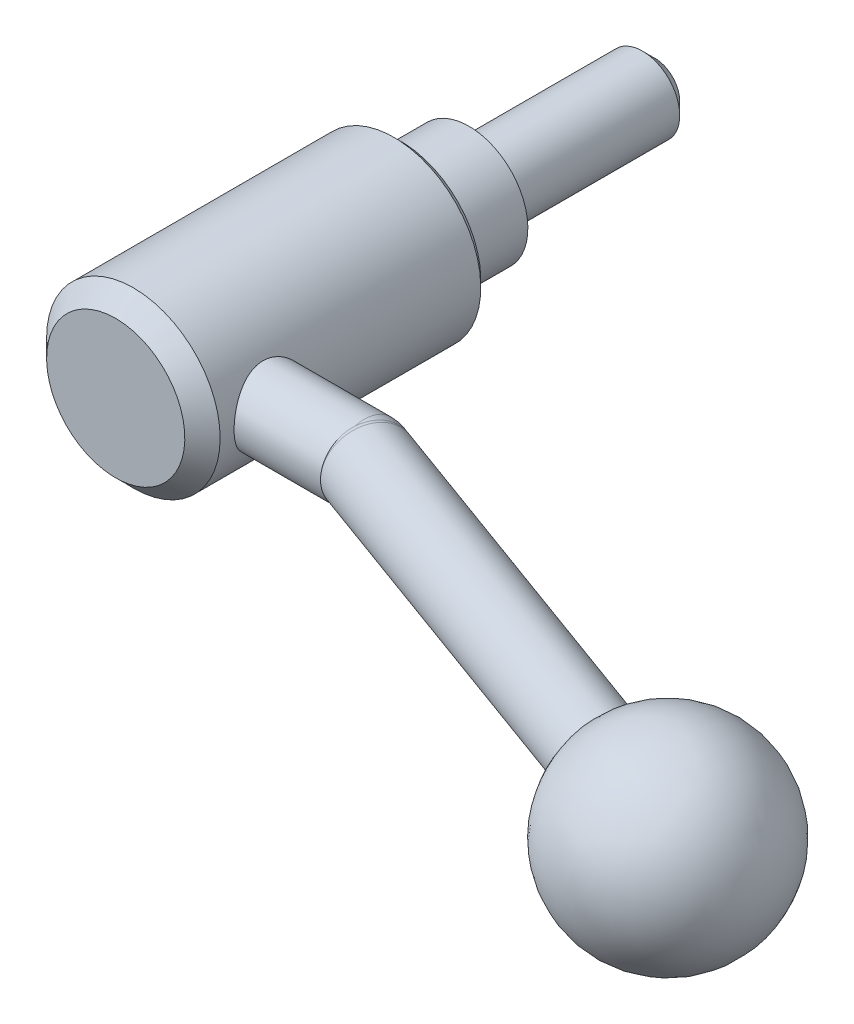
ISO-10303-21;
HEADER;
FILE_DESCRIPTION(('STEP AP214'),'2;1');
FILE_NAME('part.step','',(''),(''),'','','');
FILE_SCHEMA(('AUTOMOTIVE_DESIGN { 1 0 10303 214 1 1 1 1 }'));
ENDSEC;
DATA;
#1=APPLICATION_CONTEXT('core data for automotive mechanical design processes');
#2=APPLICATION_PROTOCOL_DEFINITION('international standard','automotive_design',2000,#1);
#3=PRODUCT_CONTEXT('',#1,'mechanical');
#4=PRODUCT('Part','Part','',(#3));
#5=PRODUCT_RELATED_PRODUCT_CATEGORY('part','',(#4));
#6=PRODUCT_DEFINITION_FORMATION('','',#4);
#7=PRODUCT_DEFINITION_CONTEXT('part definition',#1,'design');
#8=PRODUCT_DEFINITION('design','',#6,#7);
#9=PRODUCT_DEFINITION_SHAPE('','',#8);
#10=(LENGTH_UNIT() NAMED_UNIT(*) SI_UNIT(.MILLI.,.METRE.));
#11=(NAMED_UNIT(*) PLANE_ANGLE_UNIT() SI_UNIT($,.RADIAN.));
#12=(NAMED_UNIT(*) SI_UNIT($,.STERADIAN.) SOLID_ANGLE_UNIT());
#13=UNCERTAINTY_MEASURE_WITH_UNIT(LENGTH_MEASURE(1.E-05),#10,'distance_accuracy_value','');
#14=(GEOMETRIC_REPRESENTATION_CONTEXT(3) GLOBAL_UNCERTAINTY_ASSIGNED_CONTEXT((#13)) GLOBAL_UNIT_ASSIGNED_CONTEXT((#10,
#11,#12)) REPRESENTATION_CONTEXT('',''));
#15=CARTESIAN_POINT('',(0.,0.,0.));
#16=DIRECTION('',(0.,0.,1.));
#17=DIRECTION('',(1.,0.,0.));
#18=AXIS2_PLACEMENT_3D('',#15,#16,#17);
#19=CARTESIAN_POINT('',(0.,0.,-14.463244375));
#20=DIRECTION('',(0.,0.,1.));
#21=DIRECTION('',(0.,-1.,0.));
#22=AXIS2_PLACEMENT_3D('',#19,#20,#21);
#23=CYLINDRICAL_SURFACE('',#22,6.);
#24=CARTESIAN_POINT('',(0.,0.,-28.));
#25=DIRECTION('',(0.,0.,-1.));
#26=DIRECTION('',(-1.,0.,0.));
#27=AXIS2_PLACEMENT_3D('',#24,#25,#26);
#28=CIRCLE('',#27,6.);
#29=CARTESIAN_POINT('',(-6.,0.,-28.));
#30=VERTEX_POINT('',#29);
#31=EDGE_CURVE('E9',#30,#30,#28,.F.);
#32=ORIENTED_EDGE('',*,*,#31,.T.);
#33=EDGE_LOOP('',(#32));
#34=FACE_BOUND('',#33,.T.);
#35=CARTESIAN_POINT('',(0.,0.,0.));
#36=DIRECTION('',(0.,0.,1.));
#37=DIRECTION('',(0.,-1.,0.));
#38=AXIS2_PLACEMENT_3D('',#35,#36,#37);
#39=CIRCLE('',#38,6.);
#40=CARTESIAN_POINT('',(0.,-6.,0.));
#41=VERTEX_POINT('',#40);
#42=EDGE_CURVE('E144',#41,#41,#39,.T.);
#43=ORIENTED_EDGE('',*,*,#42,.F.);
#44=EDGE_LOOP('',(#43));
#45=FACE_BOUND('',#44,.T.);
#46=ADVANCED_FACE('F14',(#34,#45),#23,.T.);
#47=CARTESIAN_POINT('',(7.75,0.,0.));
#48=DIRECTION('',(0.,0.,-1.));
#49=DIRECTION('',(0.,1.,0.));
#50=AXIS2_PLACEMENT_3D('',#47,#48,#49);
#51=PLANE('',#50);
#52=ORIENTED_EDGE('',*,*,#42,.T.);
#53=EDGE_LOOP('',(#52));
#54=FACE_BOUND('',#53,.T.);
#55=CARTESIAN_POINT('',(0.,0.,0.));
#56=DIRECTION('',(0.,0.,1.));
#57=DIRECTION('',(0.,-1.,0.));
#58=AXIS2_PLACEMENT_3D('',#55,#56,#57);
#59=CIRCLE('',#58,9.5);
#60=CARTESIAN_POINT('',(0.,-9.5,0.));
#61=VERTEX_POINT('',#60);
#62=EDGE_CURVE('E141',#61,#61,#59,.T.);
#63=ORIENTED_EDGE('',*,*,#62,.F.);
#64=EDGE_LOOP('',(#63));
#65=FACE_BOUND('',#64,.T.);
#66=ADVANCED_FACE('F148',(#54,#65),#51,.T.);
#67=CARTESIAN_POINT('',(0.,0.,5.5));
#68=DIRECTION('',(0.,0.,1.));
#69=DIRECTION('',(0.,-1.,0.));
#70=AXIS2_PLACEMENT_3D('',#67,#68,#69);
#71=CYLINDRICAL_SURFACE('',#70,9.5);
#72=CARTESIAN_POINT('',(0.,0.,11.));
#73=DIRECTION('',(0.,0.,1.));
#74=DIRECTION('',(0.,-1.,0.));
#75=AXIS2_PLACEMENT_3D('',#72,#73,#74);
#76=CIRCLE('',#75,9.5);
#77=CARTESIAN_POINT('',(0.,-9.5,11.));
#78=VERTEX_POINT('',#77);
#79=EDGE_CURVE('E136',#78,#78,#76,.T.);
#80=ORIENTED_EDGE('',*,*,#79,.F.);
#81=EDGE_LOOP('',(#80));
#82=FACE_BOUND('',#81,.T.);
#83=ORIENTED_EDGE('',*,*,#62,.T.);
#84=EDGE_LOOP('',(#83));
#85=FACE_BOUND('',#84,.T.);
#86=ADVANCED_FACE('F158',(#82,#85),#71,.T.);
#87=CARTESIAN_POINT('',(11.2,0.,11.));
#88=DIRECTION('',(0.,0.,-1.));
#89=DIRECTION('',(0.,1.,0.));
#90=AXIS2_PLACEMENT_3D('',#87,#88,#89);
#91=PLANE('',#90);
#92=ORIENTED_EDGE('',*,*,#79,.T.);
#93=EDGE_LOOP('',(#92));
#94=FACE_BOUND('',#93,.T.);
#95=CARTESIAN_POINT('',(0.,0.,11.));
#96=DIRECTION('',(0.,0.,1.));
#97=DIRECTION('',(0.,-1.,0.));
#98=AXIS2_PLACEMENT_3D('',#95,#96,#97);
#99=CIRCLE('',#98,12.9);
#100=CARTESIAN_POINT('',(0.,-12.9,11.));
#101=VERTEX_POINT('',#100);
#102=EDGE_CURVE('E134',#101,#101,#99,.T.);
#103=ORIENTED_EDGE('',*,*,#102,.F.);
#104=EDGE_LOOP('',(#103));
#105=FACE_BOUND('',#104,.T.);
#106=ADVANCED_FACE('F163',(#94,#105),#91,.T.);
#107=CARTESIAN_POINT('',(5.575,0.,57.));
#108=DIRECTION('',(0.,0.,1.));
#109=DIRECTION('',(0.,-1.,0.));
#110=AXIS2_PLACEMENT_3D('',#107,#108,#109);
#111=PLANE('',#110);
#112=CARTESIAN_POINT('',(0.,0.,57.));
#113=DIRECTION('',(0.,0.,-1.));
#114=DIRECTION('',(0.,1.,0.));
#115=AXIS2_PLACEMENT_3D('',#112,#113,#114);
#116=CIRCLE('',#115,11.15);
#117=CARTESIAN_POINT('',(0.,11.15,57.));
#118=VERTEX_POINT('',#117);
#119=EDGE_CURVE('E118',#118,#118,#116,.T.);
#120=ORIENTED_EDGE('',*,*,#119,.F.);
#121=EDGE_LOOP('',(#120));
#122=FACE_BOUND('',#121,.T.);
#123=ADVANCED_FACE('F167',(#122),#111,.T.);
#124=CARTESIAN_POINT('',(0.,0.,12.1));
#125=DIRECTION('',(0.,0.,1.));
#126=DIRECTION('',(0.,-1.,0.));
#127=AXIS2_PLACEMENT_3D('',#124,#125,#126);
#128=CONICAL_SURFACE('',#127,14.,0.785398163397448);
#129=ORIENTED_EDGE('',*,*,#102,.T.);
#130=EDGE_LOOP('',(#129));
#131=FACE_BOUND('',#130,.T.);
#132=CARTESIAN_POINT('',(0.,0.,12.1));
#133=DIRECTION('',(0.,0.,1.));
#134=DIRECTION('',(0.,-1.,0.));
#135=AXIS2_PLACEMENT_3D('',#132,#133,#134);
#136=CIRCLE('',#135,14.);
#137=CARTESIAN_POINT('',(0.,-14.,12.1));
#138=VERTEX_POINT('',#137);
#139=EDGE_CURVE('E111',#138,#138,#136,.T.);
#140=ORIENTED_EDGE('',*,*,#139,.F.);
#141=EDGE_LOOP('',(#140));
#142=FACE_BOUND('',#141,.T.);
#143=ADVANCED_FACE('F129',(#131,#142),#128,.T.);
#144=CARTESIAN_POINT('',(0.,0.,54.15));
#145=DIRECTION('',(0.,0.,-1.));
#146=DIRECTION('',(0.,1.,0.));
#147=AXIS2_PLACEMENT_3D('',#144,#145,#146);
#148=CONICAL_SURFACE('',#147,14.,0.785398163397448);
#149=CARTESIAN_POINT('',(0.,0.,54.15));
#150=DIRECTION('',(0.,0.,1.));
#151=DIRECTION('',(0.,-1.,0.));
#152=AXIS2_PLACEMENT_3D('',#149,#150,#151);
#153=CIRCLE('',#152,14.);
#154=CARTESIAN_POINT('',(0.,-14.,54.15));
#155=VERTEX_POINT('',#154);
#156=EDGE_CURVE('E47',#155,#155,#153,.F.);
#157=ORIENTED_EDGE('',*,*,#156,.F.);
#158=EDGE_LOOP('',(#157));
#159=FACE_BOUND('',#158,.T.);
#160=ORIENTED_EDGE('',*,*,#119,.T.);
#161=EDGE_LOOP('',(#160));
#162=FACE_BOUND('',#161,.T.);
#163=ADVANCED_FACE('F126',(#159,#162),#148,.T.);
#164=CARTESIAN_POINT('',(0.,0.,33.125));
#165=DIRECTION('',(0.,0.,1.));
#166=DIRECTION('',(0.,-1.,0.));
#167=AXIS2_PLACEMENT_3D('',#164,#165,#166);
#168=CYLINDRICAL_SURFACE('',#167,14.);
#169=ORIENTED_EDGE('',*,*,#139,.T.);
#170=EDGE_LOOP('',(#169));
#171=FACE_BOUND('',#170,.T.);
#172=ORIENTED_EDGE('',*,*,#156,.T.);
#173=EDGE_LOOP('',(#172));
#174=FACE_BOUND('',#173,.T.);
#175=CARTESIAN_POINT('',(12.6491106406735,-6.,45.9));
#176=CARTESIAN_POINT('',(12.64910460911,-6.00000553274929,45.7401576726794));
#177=CARTESIAN_POINT('',(12.6521467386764,-5.99360993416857,45.5803670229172));
#178=CARTESIAN_POINT('',(12.6641937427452,-5.96811672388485,45.2619820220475));
#179=CARTESIAN_POINT('',(12.6731994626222,-5.94901731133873,45.103387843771));
#180=CARTESIAN_POINT('',(12.6968742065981,-5.89831833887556,44.7885665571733));
#181=CARTESIAN_POINT('',(12.7115461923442,-5.86671224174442,44.6323407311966));
#182=CARTESIAN_POINT('',(12.746064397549,-5.79133489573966,44.3233778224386));
#183=CARTESIAN_POINT('',(12.7659126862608,-5.74755878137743,44.1706421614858));
#184=CARTESIAN_POINT('',(12.8100610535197,-5.64847418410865,43.870311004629));
#185=CARTESIAN_POINT('',(12.834343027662,-5.59321247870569,43.7226974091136));
#186=CARTESIAN_POINT('',(12.8866851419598,-5.47153830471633,43.432812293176));
#187=CARTESIAN_POINT('',(12.9147467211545,-5.4051215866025,43.2905428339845));
#188=CARTESIAN_POINT('',(13.0034189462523,-5.18991043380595,42.8730011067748));
#189=CARTESIAN_POINT('',(13.0685550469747,-5.02507375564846,42.6067513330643));
#190=CARTESIAN_POINT('',(13.2082253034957,-4.64606613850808,42.0890653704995));
#191=CARTESIAN_POINT('',(13.2830881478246,-4.42954152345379,41.8394560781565));
#192=CARTESIAN_POINT('',(13.4311388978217,-3.95795352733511,41.3785903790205));
#193=CARTESIAN_POINT('',(13.5043260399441,-3.70287296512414,41.1673511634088));
#194=CARTESIAN_POINT('',(13.6088643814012,-3.28944046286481,40.8790751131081));
#195=CARTESIAN_POINT('',(13.6435464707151,-3.14284381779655,40.7860210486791));
#196=CARTESIAN_POINT('',(13.7094572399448,-2.84156827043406,40.6126899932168));
#197=CARTESIAN_POINT('',(13.7406873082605,-2.68689265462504,40.5324078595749));
#198=CARTESIAN_POINT('',(13.7987727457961,-2.37059090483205,40.3854112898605));
#199=CARTESIAN_POINT('',(13.8256317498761,-2.20897068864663,40.3186855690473));
#200=CARTESIAN_POINT('',(13.8742091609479,-1.87989388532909,40.199418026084));
#201=CARTESIAN_POINT('',(13.8959288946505,-1.71243881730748,40.14687254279));
#202=CARTESIAN_POINT('',(13.9424931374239,-1.29234447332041,40.0351169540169));
#203=CARTESIAN_POINT('',(13.9639369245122,-1.03695928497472,39.9845583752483));
#204=CARTESIAN_POINT('',(13.9926857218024,-0.521004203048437,39.9170068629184));
#205=CARTESIAN_POINT('',(13.9999930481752,-0.260435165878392,39.9000084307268));
#206=CARTESIAN_POINT('',(14.0000042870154,0.160603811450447,39.899994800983));
#207=CARTESIAN_POINT('',(13.9972323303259,0.321156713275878,39.9064506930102));
#208=CARTESIAN_POINT('',(13.9862285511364,0.641089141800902,39.9321914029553));
#209=CARTESIAN_POINT('',(13.9779959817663,0.80046850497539,39.9514779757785));
#210=CARTESIAN_POINT('',(13.9562800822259,1.11687883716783,40.0026881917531));
#211=CARTESIAN_POINT('',(13.9427945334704,1.27390878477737,40.0346171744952));
#212=CARTESIAN_POINT('',(13.9109210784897,1.58450451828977,40.1107925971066));
#213=CARTESIAN_POINT('',(13.8925312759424,1.73806893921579,40.1550438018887));
#214=CARTESIAN_POINT('',(13.8513869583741,2.04015832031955,40.2552679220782));
#215=CARTESIAN_POINT('',(13.8286466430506,2.1886978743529,40.3112027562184));
#216=CARTESIAN_POINT('',(13.7793155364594,2.48039457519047,40.4344055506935));
#217=CARTESIAN_POINT('',(13.7527233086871,2.62354968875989,40.5016777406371));
#218=CARTESIAN_POINT('',(13.696336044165,2.90357801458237,40.6469909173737));
#219=CARTESIAN_POINT('',(13.6665419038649,3.04045296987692,40.7250288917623));
#220=CARTESIAN_POINT('',(13.6044405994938,3.30726420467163,40.8913329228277));
#221=CARTESIAN_POINT('',(13.5721325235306,3.43719793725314,40.9796026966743));
#222=CARTESIAN_POINT('',(13.4693866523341,3.82753947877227,41.2677581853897));
#223=CARTESIAN_POINT('',(13.3958896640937,4.07523678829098,41.4841392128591));
#224=CARTESIAN_POINT('',(13.2483283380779,4.53206518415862,41.9543804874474));
#225=CARTESIAN_POINT('',(13.1742637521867,4.74117826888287,42.2082581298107));
#226=CARTESIAN_POINT('',(13.0667151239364,5.02713542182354,42.6200780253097));
#227=CARTESIAN_POINT('',(13.0306067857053,5.11975828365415,42.7665983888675));
#228=CARTESIAN_POINT('',(12.9615135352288,5.2922387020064,43.0676393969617));
#229=CARTESIAN_POINT('',(12.9285273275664,5.3721015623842,43.222156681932));
#230=CARTESIAN_POINT('',(12.8667726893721,5.51837579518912,43.5382497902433));
#231=CARTESIAN_POINT('',(12.8380044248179,5.58478663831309,43.699825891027));
#232=CARTESIAN_POINT('',(12.7857296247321,5.70344853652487,44.028841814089));
#233=CARTESIAN_POINT('',(12.7622203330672,5.75570701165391,44.1962785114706));
#234=CARTESIAN_POINT('',(12.7223620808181,5.84326126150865,44.5273582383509));
#235=CARTESIAN_POINT('',(12.7057155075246,5.87927054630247,44.6907767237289));
#236=CARTESIAN_POINT('',(12.6785875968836,5.9375461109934,45.0204810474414));
#237=CARTESIAN_POINT('',(12.668103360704,5.95981885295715,45.1867654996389));
#238=CARTESIAN_POINT('',(12.6536916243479,5.99035682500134,45.520851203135));
#239=CARTESIAN_POINT('',(12.6497622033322,5.99862615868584,45.6886519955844));
#240=CARTESIAN_POINT('',(12.6486085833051,6.00105865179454,46.0243741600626));
#241=CARTESIAN_POINT('',(12.6513839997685,5.99522262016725,46.1922955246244));
#242=CARTESIAN_POINT('',(12.6630276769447,5.97058551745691,46.5130358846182));
#243=CARTESIAN_POINT('',(12.6713756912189,5.95289101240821,46.6659604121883));
#244=CARTESIAN_POINT('',(12.6933550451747,5.90587935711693,46.9696771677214));
#245=CARTESIAN_POINT('',(12.7069881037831,5.87655842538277,47.120468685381));
#246=CARTESIAN_POINT('',(12.7391074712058,5.80660124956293,47.4188341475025));
#247=CARTESIAN_POINT('',(12.7575927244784,5.76596746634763,47.5664087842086));
#248=CARTESIAN_POINT('',(12.7988726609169,5.67374743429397,47.8575287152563));
#249=CARTESIAN_POINT('',(12.8216690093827,5.62215695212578,48.0010724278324));
#250=CARTESIAN_POINT('',(12.8714548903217,5.50723592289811,48.2863126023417));
#251=CARTESIAN_POINT('',(12.8985238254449,5.44367744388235,48.4279035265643));
#252=CARTESIAN_POINT('',(12.9557327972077,5.3060860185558,48.7052555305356));
#253=CARTESIAN_POINT('',(12.9858738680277,5.23204954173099,48.8410146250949));
#254=CARTESIAN_POINT('',(13.0797518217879,4.99489125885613,49.238579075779));
#255=CARTESIAN_POINT('',(13.1469738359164,4.81665343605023,49.4908372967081));
#256=CARTESIAN_POINT('',(13.2528981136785,4.51370688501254,49.8565947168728));
#257=CARTESIAN_POINT('',(13.2906740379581,4.40149613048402,49.9810439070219));
#258=CARTESIAN_POINT('',(13.3660382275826,4.16703298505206,50.2201648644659));
#259=CARTESIAN_POINT('',(13.4036265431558,4.04478345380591,50.3348393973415));
#260=CARTESIAN_POINT('',(13.4776589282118,3.79080787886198,50.5538078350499));
#261=CARTESIAN_POINT('',(13.5141019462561,3.65907347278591,50.6580923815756));
#262=CARTESIAN_POINT('',(13.5848454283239,3.38699289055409,50.8554522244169));
#263=CARTESIAN_POINT('',(13.6191467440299,3.24665018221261,50.9485319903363));
#264=CARTESIAN_POINT('',(13.6855986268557,2.95422844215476,51.1251783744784));
#265=CARTESIAN_POINT('',(13.7176667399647,2.80193548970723,51.2084225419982));
#266=CARTESIAN_POINT('',(13.7776826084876,2.49011177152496,51.3616394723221));
#267=CARTESIAN_POINT('',(13.805632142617,2.33058416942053,51.4316179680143));
#268=CARTESIAN_POINT('',(13.8565730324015,2.00558982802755,51.5575551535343));
#269=CARTESIAN_POINT('',(13.8795716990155,1.8401322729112,51.6135345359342));
#270=CARTESIAN_POINT('',(13.9199625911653,1.50439957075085,51.7109657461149));
#271=CARTESIAN_POINT('',(13.9373571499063,1.3341264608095,51.7524236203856));
#272=CARTESIAN_POINT('',(13.9675766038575,0.971306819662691,51.8240504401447));
#273=CARTESIAN_POINT('',(13.9796957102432,0.778357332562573,51.852493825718));
#274=CARTESIAN_POINT('',(13.9959066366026,0.390262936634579,51.8904675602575));
#275=CARTESIAN_POINT('',(13.9999986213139,0.195118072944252,51.8999982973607));
#276=CARTESIAN_POINT('',(14.0000011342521,-0.160524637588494,51.90000140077));
#277=CARTESIAN_POINT('',(13.9972335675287,-0.321031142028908,51.8935531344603));
#278=CARTESIAN_POINT('',(13.986238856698,-0.64087897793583,51.8678317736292));
#279=CARTESIAN_POINT('',(13.9780101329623,-0.800219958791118,51.8485549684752));
#280=CARTESIAN_POINT('',(13.9562992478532,-1.11664192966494,51.7973574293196));
#281=CARTESIAN_POINT('',(13.9428121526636,-1.27372065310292,51.7654248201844));
#282=CARTESIAN_POINT('',(13.9109322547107,-1.5844120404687,51.6892342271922));
#283=CARTESIAN_POINT('',(13.8925375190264,-1.73802331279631,51.6449713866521));
#284=CARTESIAN_POINT('',(13.8513855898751,-2.04016815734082,51.5447287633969));
#285=CARTESIAN_POINT('',(13.8286436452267,-2.18871740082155,51.4887898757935));
#286=CARTESIAN_POINT('',(13.7793086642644,-2.48043340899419,51.3655771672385));
#287=CARTESIAN_POINT('',(13.7527141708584,-2.6235981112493,51.2982990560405));
#288=CARTESIAN_POINT('',(13.6963259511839,-2.90362509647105,51.1529827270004));
#289=CARTESIAN_POINT('',(13.6665335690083,-3.04048999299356,51.074949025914));
#290=CARTESIAN_POINT('',(13.6044361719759,-3.30728201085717,50.9086549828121));
#291=CARTESIAN_POINT('',(13.5721302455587,-3.43720658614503,50.820390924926));
#292=CARTESIAN_POINT('',(13.4693921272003,-3.82751869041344,50.5322571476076));
#293=CARTESIAN_POINT('',(13.3959012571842,-4.07519777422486,50.3158947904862));
#294=CARTESIAN_POINT('',(13.2483400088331,-4.53203219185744,49.8456596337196));
#295=CARTESIAN_POINT('',(13.1742692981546,-4.74116344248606,49.5917635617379));
#296=CARTESIAN_POINT('',(13.0666998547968,-5.02717606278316,49.1798632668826));
#297=CARTESIAN_POINT('',(13.0305770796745,-5.11983460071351,49.0332803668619));
#298=CARTESIAN_POINT('',(12.9614574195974,-5.29237662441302,48.7321079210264));
#299=CARTESIAN_POINT('',(12.9284592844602,-5.37226522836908,48.5775216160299));
#300=CARTESIAN_POINT('',(12.8667153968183,-5.51850899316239,48.2614303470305));
#301=CARTESIAN_POINT('',(12.8379657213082,-5.5848766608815,48.0999319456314));
#302=CARTESIAN_POINT('',(12.7857155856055,-5.70347823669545,47.7710683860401));
#303=CARTESIAN_POINT('',(12.7622136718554,-5.75571605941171,47.6037048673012));
#304=CARTESIAN_POINT('',(12.7118372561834,-5.86638870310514,47.1851613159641));
#305=CARTESIAN_POINT('',(12.6884912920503,-5.91637540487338,46.9312534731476));
#306=CARTESIAN_POINT('',(12.657134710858,-5.9831725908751,46.418184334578));
#307=CARTESIAN_POINT('',(12.6491204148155,-5.99999103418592,46.1590243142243));
#308=CARTESIAN_POINT('',(12.6491106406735,-6.,45.9));
#309=B_SPLINE_CURVE_WITH_KNOTS('',3,(#175,#176,#177,#178,#179,#180,#181,#182,#183,#184,#185,
#186,#187,#188,#189,#190,#191,#192,#193,#194,#195,#196,#197,#198,#199,#200,#201,#202,#203,#204,
#205,#206,#207,#208,#209,#210,#211,#212,#213,#214,#215,#216,#217,#218,#219,#220,#221,#222,#223,
#224,#225,#226,#227,#228,#229,#230,#231,#232,#233,#234,#235,#236,#237,#238,#239,#240,#241,#242,
#243,#244,#245,#246,#247,#248,#249,#250,#251,#252,#253,#254,#255,#256,#257,#258,#259,#260,#261,
#262,#263,#264,#265,#266,#267,#268,#269,#270,#271,#272,#273,#274,#275,#276,#277,#278,#279,#280,
#281,#282,#283,#284,#285,#286,#287,#288,#289,#290,#291,#292,#293,#294,#295,#296,#297,#298,#299,
#300,#301,#302,#303,#304,#305,#306,#307,#308),.UNSPECIFIED.,.T.,.F.,(4,2,2,2,2,2,2,2,2,2,2,2,2,
2,2,2,2,2,2,2,2,2,2,2,2,2,2,2,2,2,2,2,2,2,2,2,2,2,2,2,2,2,2,2,2,2,2,2,2,2,2,2,2,2,2,2,2,2,2,2,2,
2,2,2,2,2,4),(0.,0.479282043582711,0.958632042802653,1.43823292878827,1.9180258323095,
2.3959016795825,2.87395998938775,3.82930518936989,4.84155293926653,5.85425310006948,
6.38488729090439,6.91530727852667,7.44528390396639,7.97512356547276,8.7561667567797,
9.53708196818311,10.0186527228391,10.5002893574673,10.9821296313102,11.4641564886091,
11.9446360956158,12.4252953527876,12.9058203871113,13.386520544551,14.3929183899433,
15.3997845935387,15.9304063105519,16.4608068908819,16.9912283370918,17.5213711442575,
18.0251862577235,18.5287641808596,19.032194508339,19.5355959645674,19.9975669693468,
20.4596883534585,20.921709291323,21.3839090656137,21.856015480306,22.3282813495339,
23.27227458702,23.7871505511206,24.3018803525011,24.8170696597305,25.3320527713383,
25.860860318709,26.3894388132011,26.9172313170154,27.4448037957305,28.029946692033,
28.6150775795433,29.0964677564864,29.5779972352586,30.0599796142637,30.5421521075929,
31.0226633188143,31.5033567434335,31.9838489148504,32.4645161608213,33.4708348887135,
34.4777802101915,35.008620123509,35.5392467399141,36.0693802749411,36.599366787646,
37.3762292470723,38.1529052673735),.UNSPECIFIED.);
#310=CARTESIAN_POINT('',(12.6491106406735,-6.,45.9));
#311=VERTEX_POINT('',#310);
#312=EDGE_CURVE('E46',#311,#311,#309,.T.);
#313=ORIENTED_EDGE('',*,*,#312,.F.);
#314=EDGE_LOOP('',(#313));
#315=FACE_BOUND('',#314,.T.);
#316=ADVANCED_FACE('F123',(#171,#174,#315),#168,.T.);
#317=CARTESIAN_POINT('',(29.,0.,45.9));
#318=DIRECTION('',(1.,0.,0.));
#319=DIRECTION('',(0.,0.,1.));
#320=AXIS2_PLACEMENT_3D('',#317,#318,#319);
#321=SPHERICAL_SURFACE('',#320,6.);
#322=CARTESIAN_POINT('',(29.,0.,45.9));
#323=DIRECTION('',(-1.,0.,0.));
#324=DIRECTION('',(0.,-1.,0.));
#325=AXIS2_PLACEMENT_3D('',#322,#323,#324);
#326=CIRCLE('',#325,6.);
#327=CARTESIAN_POINT('',(29.,5.79723335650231,47.4466368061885));
#328=VERTEX_POINT('',#327);
#329=CARTESIAN_POINT('',(29.,-5.79723335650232,47.4466368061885));
#330=VERTEX_POINT('',#329);
#331=EDGE_CURVE('E35',#328,#330,#326,.T.);
#332=ORIENTED_EDGE('',*,*,#331,.F.);
#333=CARTESIAN_POINT('',(29.,-5.79723335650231,47.4466368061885));
#334=CARTESIAN_POINT('',(29.0557645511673,-5.83812719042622,47.2934249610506));
#335=CARTESIAN_POINT('',(29.1121209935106,-5.87210735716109,47.1385869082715));
#336=CARTESIAN_POINT('',(29.2256095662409,-5.92607580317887,46.826779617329));
#337=CARTESIAN_POINT('',(29.2827416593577,-5.94606475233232,46.6698104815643));
#338=CARTESIAN_POINT('',(29.397338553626,-5.97188107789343,46.3549581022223));
#339=CARTESIAN_POINT('',(29.4548030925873,-5.97771840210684,46.1970755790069));
#340=CARTESIAN_POINT('',(29.5696954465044,-5.97522465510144,45.8814114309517));
#341=CARTESIAN_POINT('',(29.6271232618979,-5.96689375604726,45.7236298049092));
#342=CARTESIAN_POINT('',(29.7415513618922,-5.93611715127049,45.4092411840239));
#343=CARTESIAN_POINT('',(29.7985515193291,-5.91366740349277,45.2526345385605));
#344=CARTESIAN_POINT('',(29.9117233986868,-5.85479849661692,44.9416973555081));
#345=CARTESIAN_POINT('',(29.9678948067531,-5.81837417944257,44.7873676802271));
#346=CARTESIAN_POINT('',(30.07895660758,-5.73184022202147,44.482227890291));
#347=CARTESIAN_POINT('',(30.1338477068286,-5.68173833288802,44.3314158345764));
#348=CARTESIAN_POINT('',(30.2420117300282,-5.56817525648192,44.0342376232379));
#349=CARTESIAN_POINT('',(30.2952840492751,-5.50470914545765,43.8878731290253));
#350=CARTESIAN_POINT('',(30.3997923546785,-5.36490433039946,43.6007389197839));
#351=CARTESIAN_POINT('',(30.4510290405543,-5.28857009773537,43.4599672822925));
#352=CARTESIAN_POINT('',(30.5511400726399,-5.12352558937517,43.1849144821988));
#353=CARTESIAN_POINT('',(30.6000135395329,-5.03481075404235,43.0506357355));
#354=CARTESIAN_POINT('',(30.6950199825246,-4.84567787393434,42.7896076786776));
#355=CARTESIAN_POINT('',(30.741153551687,-4.74526237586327,42.6628567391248));
#356=CARTESIAN_POINT('',(30.8303803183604,-4.53338722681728,42.4177082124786));
#357=CARTESIAN_POINT('',(30.8734723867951,-4.4219235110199,42.2993137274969));
#358=CARTESIAN_POINT('',(30.9562737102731,-4.18882415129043,42.0718189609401));
#359=CARTESIAN_POINT('',(30.9959843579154,-4.06719273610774,41.9627148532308));
#360=CARTESIAN_POINT('',(31.0717745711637,-3.81453588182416,41.7544829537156));
#361=CARTESIAN_POINT('',(31.1078527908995,-3.68350699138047,41.6553588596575));
#362=CARTESIAN_POINT('',(31.1760900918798,-3.41308529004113,41.4678784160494));
#363=CARTESIAN_POINT('',(31.2082508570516,-3.27369611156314,41.3795174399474));
#364=CARTESIAN_POINT('',(31.2684539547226,-2.98744059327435,41.2141107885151));
#365=CARTESIAN_POINT('',(31.2964947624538,-2.84057151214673,41.1370693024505));
#366=CARTESIAN_POINT('',(31.3482353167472,-2.54049920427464,40.9949132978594));
#367=CARTESIAN_POINT('',(31.371936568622,-2.3872981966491,40.9297946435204));
#368=CARTESIAN_POINT('',(31.4148496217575,-2.07554959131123,40.8118919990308));
#369=CARTESIAN_POINT('',(31.4340597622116,-1.91700004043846,40.7591125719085));
#370=CARTESIAN_POINT('',(31.4678364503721,-1.59577604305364,40.6663118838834));
#371=CARTESIAN_POINT('',(31.482404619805,-1.43310305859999,40.6262861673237));
#372=CARTESIAN_POINT('',(31.5068088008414,-1.10473356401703,40.5592362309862));
#373=CARTESIAN_POINT('',(31.5166430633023,-0.939035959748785,40.532216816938));
#374=CARTESIAN_POINT('',(31.5389073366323,-0.439292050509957,40.4710462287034));
#375=CARTESIAN_POINT('',(31.5441357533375,-0.102242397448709,40.4566812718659));
#376=CARTESIAN_POINT('',(31.5351589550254,0.569455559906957,40.4813448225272));
#377=CARTESIAN_POINT('',(31.5209537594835,0.904103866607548,40.520373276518));
#378=CARTESIAN_POINT('',(31.4735308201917,1.56172931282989,40.6506667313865));
#379=CARTESIAN_POINT('',(31.4403129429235,1.88470637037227,40.7419320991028));
#380=CARTESIAN_POINT('',(31.3558032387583,2.50975337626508,40.9741206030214));
#381=CARTESIAN_POINT('',(31.3045116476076,2.81182359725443,41.1150430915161));
#382=CARTESIAN_POINT('',(31.1853123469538,3.38650029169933,41.4425404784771));
#383=CARTESIAN_POINT('',(31.1174048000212,3.65910705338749,41.629114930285));
#384=CARTESIAN_POINT('',(30.9668980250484,4.16712588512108,42.0426288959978));
#385=CARTESIAN_POINT('',(30.8842983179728,4.40253674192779,42.2695697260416));
#386=CARTESIAN_POINT('',(30.7067542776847,4.82947107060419,42.7573679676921));
#387=CARTESIAN_POINT('',(30.6118099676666,5.02099462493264,43.0182253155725));
#388=CARTESIAN_POINT('',(30.4122730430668,5.35471233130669,43.5664485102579));
#389=CARTESIAN_POINT('',(30.3076807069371,5.49690790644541,43.8538135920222));
#390=CARTESIAN_POINT('',(30.0918053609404,5.72795934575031,44.4469262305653));
#391=CARTESIAN_POINT('',(29.9805214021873,5.81680762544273,44.7526763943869));
#392=CARTESIAN_POINT('',(29.7544411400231,5.93858745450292,45.3738268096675));
#393=CARTESIAN_POINT('',(29.6396457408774,5.97153327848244,45.6892245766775));
#394=CARTESIAN_POINT('',(29.4363937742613,5.97959153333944,46.247654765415));
#395=CARTESIAN_POINT('',(29.3479764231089,5.96630208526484,46.4905794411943));
#396=CARTESIAN_POINT('',(29.2164293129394,5.92144536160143,46.8520021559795));
#397=CARTESIAN_POINT('',(29.1727720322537,5.90234809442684,46.9719495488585));
#398=CARTESIAN_POINT('',(29.0859636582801,5.85593456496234,47.2104535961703));
#399=CARTESIAN_POINT('',(29.0428126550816,5.82861686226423,47.3290100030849));
#400=CARTESIAN_POINT('',(29.,5.79723335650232,47.4466368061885));
#401=B_SPLINE_CURVE_WITH_KNOTS('',3,(#333,#334,#335,#336,#337,#338,#339,#340,#341,#342,#343,
#344,#345,#346,#347,#348,#349,#350,#351,#352,#353,#354,#355,#356,#357,#358,#359,#360,#361,#362,
#363,#364,#365,#366,#367,#368,#369,#370,#371,#372,#373,#374,#375,#376,#377,#378,#379,#380,#381,
#382,#383,#384,#385,#386,#387,#388,#389,#390,#391,#392,#393,#394,#395,#396,#397,#398,#399,#400),
.UNSPECIFIED.,.F.,.F.,(4,2,2,2,2,2,2,2,2,2,2,2,2,2,2,2,2,2,2,2,2,2,2,2,2,2,2,2,2,2,2,2,2,4),(0.,
0.504130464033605,1.00823678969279,1.51198865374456,2.01573439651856,2.51962442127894,
3.02370061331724,3.52749173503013,4.03146879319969,4.53527109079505,5.03925942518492,
5.54313826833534,6.04720318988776,6.55105950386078,7.05510182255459,7.55892670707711,
8.06293758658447,8.56677330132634,9.07079504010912,9.57464049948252,10.0786719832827,
11.0856436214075,12.0926142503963,13.0995919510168,14.1065565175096,15.1135112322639,
16.1204987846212,17.127484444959,18.1344410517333,19.141540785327,20.1483833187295,
20.9227248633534,21.3096814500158,21.6967058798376),.UNSPECIFIED.);
#402=EDGE_CURVE('E49',#330,#328,#401,.T.);
#403=ORIENTED_EDGE('',*,*,#402,.F.);
#404=EDGE_LOOP('',(#332,#403));
#405=FACE_BOUND('',#404,.T.);
#406=ADVANCED_FACE('F50',(#405),#321,.T.);
#407=CARTESIAN_POINT('',(14.5,0.,45.9));
#408=DIRECTION('',(-1.,0.,0.));
#409=DIRECTION('',(0.,-1.,0.));
#410=AXIS2_PLACEMENT_3D('',#407,#408,#409);
#411=CYLINDRICAL_SURFACE('',#410,6.);
#412=CARTESIAN_POINT('',(27.9420381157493,0.,51.9));
#413=CARTESIAN_POINT('',(27.9420394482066,-0.166535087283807,51.9000193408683));
#414=CARTESIAN_POINT('',(27.9432607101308,-0.33306709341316,51.8930673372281));
#415=CARTESIAN_POINT('',(27.9481523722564,-0.664932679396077,51.8653605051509));
#416=CARTESIAN_POINT('',(27.9518226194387,-0.830266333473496,51.8446065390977));
#417=CARTESIAN_POINT('',(27.9616185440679,-1.1584640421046,51.7894524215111));
#418=CARTESIAN_POINT('',(27.9677427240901,-1.3213295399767,51.7550605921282));
#419=CARTESIAN_POINT('',(27.9824660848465,-1.64353559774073,51.6729046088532));
#420=CARTESIAN_POINT('',(27.9910652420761,-1.80287619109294,51.6251405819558));
#421=CARTESIAN_POINT('',(28.0107684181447,-2.11692207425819,51.5166045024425));
#422=CARTESIAN_POINT('',(28.0218726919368,-2.27162689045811,51.4558311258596));
#423=CARTESIAN_POINT('',(28.04663219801,-2.57536385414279,51.321722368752));
#424=CARTESIAN_POINT('',(28.0602885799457,-2.72439340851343,51.2483813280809));
#425=CARTESIAN_POINT('',(28.0902001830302,-3.01561279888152,51.0897555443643));
#426=CARTESIAN_POINT('',(28.1064544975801,-3.15780499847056,51.0044749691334));
#427=CARTESIAN_POINT('',(28.1416340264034,-3.4343587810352,50.8226570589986));
#428=CARTESIAN_POINT('',(28.1605580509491,-3.56872381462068,50.7261247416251));
#429=CARTESIAN_POINT('',(28.2012637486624,-3.82927101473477,50.522138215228));
#430=CARTESIAN_POINT('',(28.2230560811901,-3.95541989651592,50.414643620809));
#431=CARTESIAN_POINT('',(28.2695844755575,-4.1981145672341,50.189893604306));
#432=CARTESIAN_POINT('',(28.2943205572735,-4.31466029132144,50.0726381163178));
#433=CARTESIAN_POINT('',(28.3469412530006,-4.53741042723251,49.8292656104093));
#434=CARTESIAN_POINT('',(28.3748269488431,-4.64361126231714,49.7031455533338));
#435=CARTESIAN_POINT('',(28.4340144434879,-4.84493909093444,49.4431060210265));
#436=CARTESIAN_POINT('',(28.4653162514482,-4.94006605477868,49.3091865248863));
#437=CARTESIAN_POINT('',(28.5310255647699,-5.11676279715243,49.0375840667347));
#438=CARTESIAN_POINT('',(28.5653535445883,-5.19857640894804,48.9000402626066));
#439=CARTESIAN_POINT('',(28.6381984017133,-5.3505642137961,48.6197177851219));
#440=CARTESIAN_POINT('',(28.6767149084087,-5.42073943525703,48.4769395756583));
#441=CARTESIAN_POINT('',(28.7382572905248,-5.51700566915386,48.2598578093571));
#442=CARTESIAN_POINT('',(28.7594066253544,-5.5476032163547,48.1869880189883));
#443=CARTESIAN_POINT('',(28.8031193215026,-5.60576725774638,48.0404635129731));
#444=CARTESIAN_POINT('',(28.825682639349,-5.63333384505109,47.9668088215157));
#445=CARTESIAN_POINT('',(28.8724170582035,-5.68541693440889,47.8189007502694));
#446=CARTESIAN_POINT('',(28.8965887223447,-5.70993235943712,47.7446471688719));
#447=CARTESIAN_POINT('',(28.9468138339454,-5.75589127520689,47.5958172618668));
#448=CARTESIAN_POINT('',(28.9728674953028,-5.77733441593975,47.521240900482));
#449=CARTESIAN_POINT('',(29.,-5.79723335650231,47.4466368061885));
#450=B_SPLINE_CURVE_WITH_KNOTS('',3,(#412,#413,#414,#415,#416,#417,#418,#419,#420,#421,#422,
#423,#424,#425,#426,#427,#428,#429,#430,#431,#432,#433,#434,#435,#436,#437,#438,#439,#440,#441,
#442,#443,#444,#445,#446,#447,#448,#449),.UNSPECIFIED.,.F.,.F.,(4,2,2,2,2,2,2,2,2,2,2,2,2,2,2,2,
2,2,4),(0.,0.499451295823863,0.998871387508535,1.49798718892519,1.99709825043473,
2.49626013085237,2.99564741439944,3.49486080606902,3.99385242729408,4.49475374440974,
4.99565844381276,5.49673572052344,5.99781434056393,6.48831347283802,6.97876923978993,
7.22415206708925,7.46952735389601,7.71498901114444,7.96047861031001),.UNSPECIFIED.);
#451=CARTESIAN_POINT('',(27.9420381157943,0.,51.9));
#452=VERTEX_POINT('',#451);
#453=EDGE_CURVE('E42',#452,#330,#450,.T.);
#454=ORIENTED_EDGE('',*,*,#453,.F.);
#455=CARTESIAN_POINT('',(29.,5.79723335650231,47.4466368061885));
#456=CARTESIAN_POINT('',(28.9723130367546,5.77692718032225,47.5227686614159));
#457=CARTESIAN_POINT('',(28.9457482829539,5.75501279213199,47.5988708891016));
#458=CARTESIAN_POINT('',(28.8945727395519,5.70798462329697,47.7507333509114));
#459=CARTESIAN_POINT('',(28.8699617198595,5.68287122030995,47.8264936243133));
#460=CARTESIAN_POINT('',(28.8224049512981,5.62946641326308,47.9773816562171));
#461=CARTESIAN_POINT('',(28.7994586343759,5.60117610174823,48.0525096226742));
#462=CARTESIAN_POINT('',(28.7550276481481,5.54144116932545,48.2019353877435));
#463=CARTESIAN_POINT('',(28.7335430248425,5.50999644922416,48.2762331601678));
#464=CARTESIAN_POINT('',(28.6710654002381,5.4110223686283,48.4974817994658));
#465=CARTESIAN_POINT('',(28.6320085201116,5.33880726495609,48.642917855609));
#466=CARTESIAN_POINT('',(28.5582125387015,5.18229062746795,48.928260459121));
#467=CARTESIAN_POINT('',(28.5234737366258,5.09798825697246,49.0681666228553));
#468=CARTESIAN_POINT('',(28.4577828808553,4.91785982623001,49.3411288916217));
#469=CARTESIAN_POINT('',(28.4268278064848,4.82204308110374,49.4741904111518));
#470=CARTESIAN_POINT('',(28.3682949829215,4.61943382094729,49.7324629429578));
#471=CARTESIAN_POINT('',(28.3407171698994,4.51264151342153,49.857674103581));
#472=CARTESIAN_POINT('',(28.2886811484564,4.28880603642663,50.0991954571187));
#473=CARTESIAN_POINT('',(28.2642219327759,4.17176619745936,50.2155085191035));
#474=CARTESIAN_POINT('',(28.2182226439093,3.92818288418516,50.438350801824));
#475=CARTESIAN_POINT('',(28.1966825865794,3.80163935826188,50.5448799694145));
#476=CARTESIAN_POINT('',(28.1561746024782,3.53854954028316,50.7483613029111));
#477=CARTESIAN_POINT('',(28.1372355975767,3.4019132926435,50.8452029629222));
#478=CARTESIAN_POINT('',(28.1020833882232,3.12070655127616,51.0273056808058));
#479=CARTESIAN_POINT('',(28.0858714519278,2.97613240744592,51.1125613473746));
#480=CARTESIAN_POINT('',(28.0561017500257,2.6800837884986,51.2707849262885));
#481=CARTESIAN_POINT('',(28.0425448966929,2.528606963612,51.3437486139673));
#482=CARTESIAN_POINT('',(28.0180414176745,2.21995704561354,51.4767386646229));
#483=CARTESIAN_POINT('',(28.0070935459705,2.06278671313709,51.5367712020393));
#484=CARTESIAN_POINT('',(27.9881595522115,1.7504285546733,51.6412531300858));
#485=CARTESIAN_POINT('',(27.9800695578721,1.59542814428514,51.6862448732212));
#486=CARTESIAN_POINT('',(27.9662176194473,1.2822107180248,51.7636132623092));
#487=CARTESIAN_POINT('',(27.9604556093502,1.12399379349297,51.7959902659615));
#488=CARTESIAN_POINT('',(27.9512410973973,0.805364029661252,51.847893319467));
#489=CARTESIAN_POINT('',(27.9477891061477,0.644950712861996,51.8674165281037));
#490=CARTESIAN_POINT('',(27.9431881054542,0.323025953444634,51.8934789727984));
#491=CARTESIAN_POINT('',(27.9420393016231,0.16151441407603,51.9000170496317));
#492=CARTESIAN_POINT('',(27.9420381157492,0.,51.9));
#493=B_SPLINE_CURVE_WITH_KNOTS('',3,(#455,#456,#457,#458,#459,#460,#461,#462,#463,#464,#465,
#466,#467,#468,#469,#470,#471,#472,#473,#474,#475,#476,#477,#478,#479,#480,#481,#482,#483,#484,
#485,#486,#487,#488,#489,#490,#491,#492),.UNSPECIFIED.,.F.,.F.,(4,2,2,2,2,2,2,2,2,2,2,2,2,2,2,2,
2,2,4),(0.,0.250514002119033,0.500998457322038,0.75139703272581,1.00180348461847,
1.50218745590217,2.0026060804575,2.50262255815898,3.0026295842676,3.50247470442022,
4.00232253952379,4.50734262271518,5.01259690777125,5.51802449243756,6.02321020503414,
6.5074762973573,6.99172865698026,7.47608802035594,7.96049062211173),.UNSPECIFIED.);
#494=EDGE_CURVE('E44',#328,#452,#493,.T.);
#495=ORIENTED_EDGE('',*,*,#494,.F.);
#496=ORIENTED_EDGE('',*,*,#331,.T.);
#497=EDGE_LOOP('',(#454,#495,#496));
#498=FACE_BOUND('',#497,.T.);
#499=ORIENTED_EDGE('',*,*,#312,.T.);
#500=EDGE_LOOP('',(#499));
#501=FACE_BOUND('',#500,.T.);
#502=ADVANCED_FACE('F39',(#498,#501),#411,.T.);
#503=CARTESIAN_POINT('',(29.9941589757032,0.,46.2618442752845));
#504=DIRECTION('',(1.,0.,0.));
#505=DIRECTION('',(0.,0.,1.));
#506=AXIS2_PLACEMENT_3D('',#503,#504,#505);
#507=SPHERICAL_SURFACE('',#506,6.);
#508=ORIENTED_EDGE('',*,*,#402,.T.);
#509=ORIENTED_EDGE('',*,*,#494,.T.);
#510=CARTESIAN_POINT('',(29.9941589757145,0.,46.2618442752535));
#511=DIRECTION('',(-0.939692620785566,0.,-0.34202014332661));
#512=DIRECTION('',(0.34202014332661,0.,-0.939692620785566));
#513=AXIS2_PLACEMENT_3D('',#510,#511,#512);
#514=CIRCLE('',#513,6.);
#515=EDGE_CURVE('E55',#452,#452,#514,.F.);
#516=ORIENTED_EDGE('',*,*,#515,.F.);
#517=ORIENTED_EDGE('',*,*,#453,.T.);
#518=EDGE_LOOP('',(#508,#509,#516,#517));
#519=FACE_BOUND('',#518,.T.);
#520=ADVANCED_FACE('F54',(#519),#507,.T.);
#521=CARTESIAN_POINT('',(61.0281324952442,0.,57.557286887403));
#522=DIRECTION('',(-0.939692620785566,0.,-0.34202014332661));
#523=DIRECTION('',(0.34202014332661,0.,-0.939692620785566));
#524=AXIS2_PLACEMENT_3D('',#521,#522,#523);
#525=CYLINDRICAL_SURFACE('',#524,6.);
#526=ORIENTED_EDGE('',*,*,#515,.T.);
#527=EDGE_LOOP('',(#526));
#528=FACE_BOUND('',#527,.T.);
#529=CARTESIAN_POINT('',(92.0621060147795,0.,68.8527294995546));
#530=DIRECTION('',(-0.939692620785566,0.,-0.34202014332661));
#531=DIRECTION('',(0.34202014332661,0.,-0.939692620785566));
#532=AXIS2_PLACEMENT_3D('',#529,#530,#531);
#533=CIRCLE('',#532,6.);
#534=CARTESIAN_POINT('',(94.1142268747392,0.,63.2145737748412));
#535=VERTEX_POINT('',#534);
#536=EDGE_CURVE('E105',#535,#535,#533,.F.);
#537=ORIENTED_EDGE('',*,*,#536,.F.);
#538=EDGE_LOOP('',(#537));
#539=FACE_BOUND('',#538,.T.);
#540=ADVANCED_FACE('F81',(#528,#539),#525,.T.);
#541=CARTESIAN_POINT('',(106.,0.,73.9257080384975));
#542=DIRECTION('',(1.,0.,0.));
#543=DIRECTION('',(0.,0.,1.));
#544=AXIS2_PLACEMENT_3D('',#541,#542,#543);
#545=SPHERICAL_SURFACE('',#544,16.);
#546=CARTESIAN_POINT('',(122.,0.,73.9257080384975));
#547=VERTEX_POINT('',#546);
#548=VERTEX_LOOP('',#547);
#549=FACE_BOUND('',#548,.T.);
#550=ORIENTED_EDGE('',*,*,#536,.T.);
#551=EDGE_LOOP('',(#550));
#552=FACE_BOUND('',#551,.T.);
#553=ADVANCED_FACE('F90',(#549,#552),#545,.T.);
#554=CARTESIAN_POINT('',(2.463244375,0.,-30.));
#555=DIRECTION('',(0.,0.,-1.));
#556=DIRECTION('',(0.,1.,0.));
#557=AXIS2_PLACEMENT_3D('',#554,#555,#556);
#558=PLANE('',#557);
#559=CARTESIAN_POINT('',(0.,0.,-30.));
#560=DIRECTION('',(0.,0.,-1.));
#561=DIRECTION('',(-1.,0.,0.));
#562=AXIS2_PLACEMENT_3D('',#559,#560,#561);
#563=CIRCLE('',#562,4.);
#564=CARTESIAN_POINT('',(-4.,0.,-30.));
#565=VERTEX_POINT('',#564);
#566=EDGE_CURVE('E23',#565,#565,#563,.T.);
#567=ORIENTED_EDGE('',*,*,#566,.T.);
#568=EDGE_LOOP('',(#567));
#569=FACE_BOUND('',#568,.T.);
#570=ADVANCED_FACE('F92',(#569),#558,.T.);
#571=CARTESIAN_POINT('',(0.,0.,-30.));
#572=DIRECTION('',(0.,0.,1.));
#573=DIRECTION('',(1.,0.,0.));
#574=AXIS2_PLACEMENT_3D('',#571,#572,#573);
#575=CONICAL_SURFACE('',#574,4.,0.785398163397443);
#576=ORIENTED_EDGE('',*,*,#31,.F.);
#577=EDGE_LOOP('',(#576));
#578=FACE_BOUND('',#577,.T.);
#579=ORIENTED_EDGE('',*,*,#566,.F.);
#580=EDGE_LOOP('',(#579));
#581=FACE_BOUND('',#580,.T.);
#582=ADVANCED_FACE('F16',(#578,#581),#575,.T.);
#583=CLOSED_SHELL('',(#46,#66,#86,#106,#123,#143,#163,#316,#406,#502,#520,#540,#553,#570,#582));
#584=MANIFOLD_SOLID_BREP('B1',#583);
#585=ADVANCED_BREP_SHAPE_REPRESENTATION('',(#18,#584),#14);
#586=SHAPE_DEFINITION_REPRESENTATION(#9,#585);
ENDSEC;
END-ISO-10303-21;
